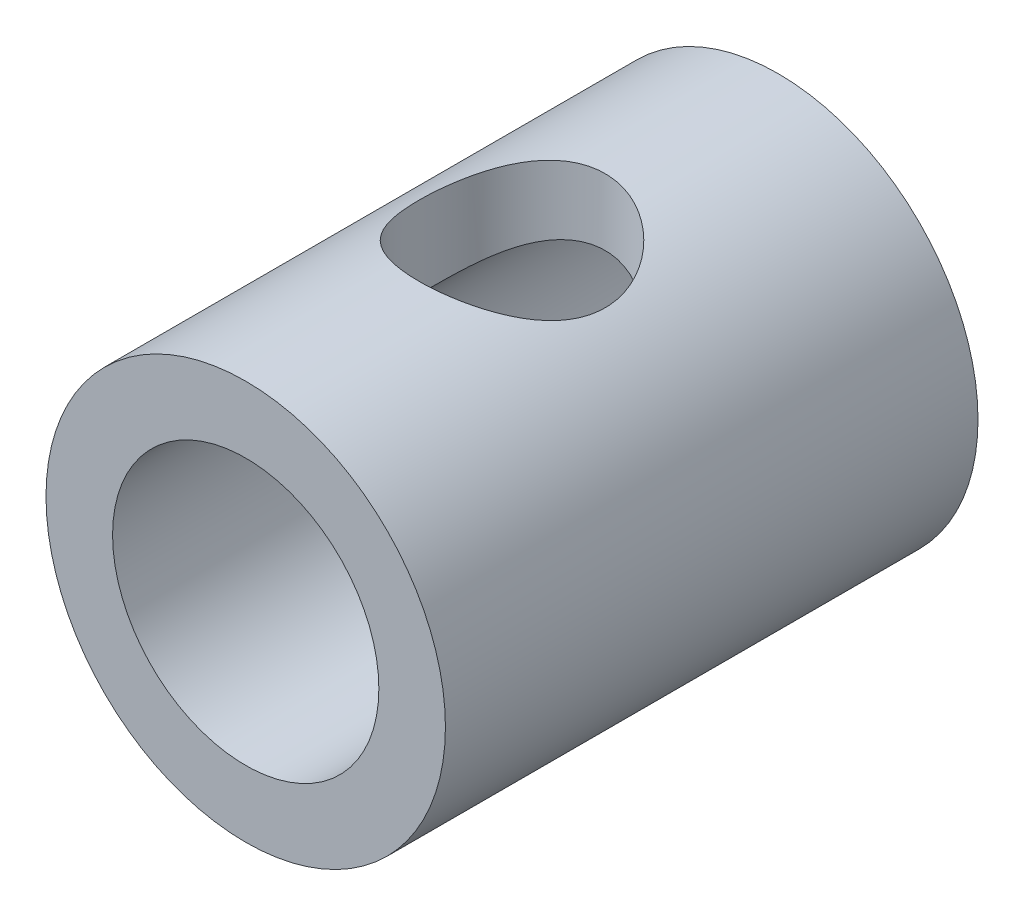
from build123d import *

# Parameters (mm, degrees)
SKETCH_1_R               = 15
EXTRUDE_1_DEPTH          = 40
SKETCH_3_R               = 10
CUT_EXTRUDE_1_DEPTH      = 46.276925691
CUT_EXTRUDE_3_DEPTH      = 46.276925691
CUT_EXTRUDE_3_DEPTH_BACK = 46.276925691
SKETCH_6_R               = 7


with BuildPart() as part:
    # Sketch 1 → Extrude 1 (new body)
    with BuildSketch(Plane.XY):
        Circle(SKETCH_1_R)
    extrude(amount=EXTRUDE_1_DEPTH)

    # Sketch 3 → Cut-Extrude 1 (cut, through all)
    with BuildSketch(Plane.XY.offset(40)):
        Circle(SKETCH_3_R)
    extrude(amount=-CUT_EXTRUDE_1_DEPTH, mode=Mode.SUBTRACT)

    # Sketch 6 → Cut-Extrude 3 (cut, two sides: drawn at the far end of the back side and taken through both)
    with BuildSketch(Plane(origin=(0, 0, 0), x_dir=(1, 0, 0), z_dir=(0, 1, 0)).offset(-CUT_EXTRUDE_3_DEPTH_BACK)):
        with Locations(Location((0, -20, 0), (0, 0, 270))):
            Circle(SKETCH_6_R)
    extrude(amount=CUT_EXTRUDE_3_DEPTH + CUT_EXTRUDE_3_DEPTH_BACK, mode=Mode.SUBTRACT)


solid = part.part
